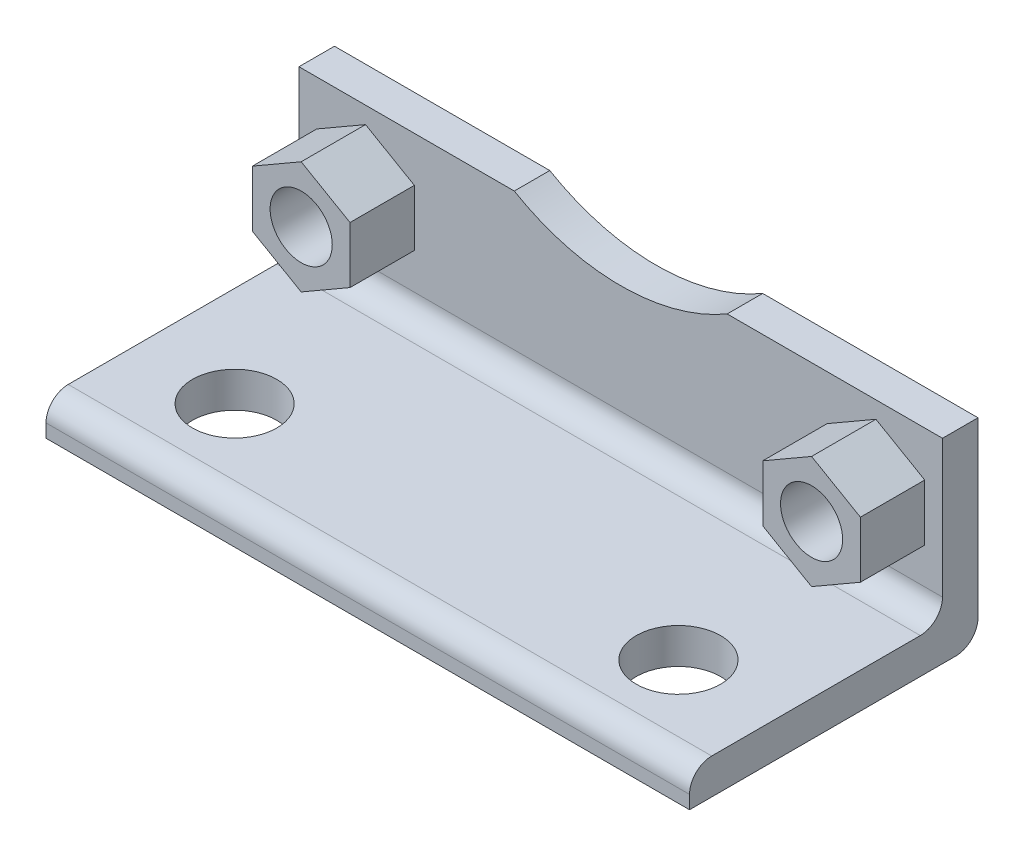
ISO-10303-21;
HEADER;
FILE_DESCRIPTION(('STEP AP214'),'2;1');
FILE_NAME('part.step','',(''),(''),'','','');
FILE_SCHEMA(('AUTOMOTIVE_DESIGN { 1 0 10303 214 1 1 1 1 }'));
ENDSEC;
DATA;
#1=APPLICATION_CONTEXT('core data for automotive mechanical design processes');
#2=APPLICATION_PROTOCOL_DEFINITION('international standard','automotive_design',2000,#1);
#3=PRODUCT_CONTEXT('',#1,'mechanical');
#4=PRODUCT('Part','Part','',(#3));
#5=PRODUCT_RELATED_PRODUCT_CATEGORY('part','',(#4));
#6=PRODUCT_DEFINITION_FORMATION('','',#4);
#7=PRODUCT_DEFINITION_CONTEXT('part definition',#1,'design');
#8=PRODUCT_DEFINITION('design','',#6,#7);
#9=PRODUCT_DEFINITION_SHAPE('','',#8);
#10=(LENGTH_UNIT() NAMED_UNIT(*) SI_UNIT(.MILLI.,.METRE.));
#11=(NAMED_UNIT(*) PLANE_ANGLE_UNIT() SI_UNIT($,.RADIAN.));
#12=(NAMED_UNIT(*) SI_UNIT($,.STERADIAN.) SOLID_ANGLE_UNIT());
#13=UNCERTAINTY_MEASURE_WITH_UNIT(LENGTH_MEASURE(1.E-05),#10,'distance_accuracy_value','');
#14=(GEOMETRIC_REPRESENTATION_CONTEXT(3) GLOBAL_UNCERTAINTY_ASSIGNED_CONTEXT((#13)) GLOBAL_UNIT_ASSIGNED_CONTEXT((#10,
#11,#12)) REPRESENTATION_CONTEXT('',''));
#15=CARTESIAN_POINT('',(0.,0.,0.));
#16=DIRECTION('',(0.,0.,1.));
#17=DIRECTION('',(1.,0.,0.));
#18=AXIS2_PLACEMENT_3D('',#15,#16,#17);
#19=CARTESIAN_POINT('',(-72.5,-41.,-37.));
#20=DIRECTION('',(0.,1.,0.));
#21=DIRECTION('',(0.,0.,1.));
#22=AXIS2_PLACEMENT_3D('',#19,#20,#21);
#23=PLANE('',#22);
#24=DIRECTION('',(0.,0.,1.));
#25=VECTOR('',#24,1.);
#26=CARTESIAN_POINT('',(-23.9843699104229,-41.,-45.));
#27=LINE('',#26,#25);
#28=CARTESIAN_POINT('',(-23.9843699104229,-41.,-45.));
#29=VERTEX_POINT('',#28);
#30=CARTESIAN_POINT('',(-23.9843699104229,-41.,-37.));
#31=VERTEX_POINT('',#30);
#32=EDGE_CURVE('E189',#29,#31,#27,.T.);
#33=ORIENTED_EDGE('',*,*,#32,.F.);
#34=DIRECTION('',(1.,0.,0.));
#35=VECTOR('',#34,1.);
#36=CARTESIAN_POINT('',(-72.5,-41.,-45.));
#37=LINE('',#36,#35);
#38=CARTESIAN_POINT('',(-72.5,-41.,-45.));
#39=VERTEX_POINT('',#38);
#40=EDGE_CURVE('E200',#39,#29,#37,.T.);
#41=ORIENTED_EDGE('',*,*,#40,.F.);
#42=DIRECTION('',(0.,0.,1.));
#43=VECTOR('',#42,1.);
#44=CARTESIAN_POINT('',(-72.5,-41.,-37.));
#45=LINE('',#44,#43);
#46=CARTESIAN_POINT('',(-72.5,-41.,-37.));
#47=VERTEX_POINT('',#46);
#48=EDGE_CURVE('E272',#39,#47,#45,.T.);
#49=ORIENTED_EDGE('',*,*,#48,.T.);
#50=DIRECTION('',(1.,0.,0.));
#51=VECTOR('',#50,1.);
#52=CARTESIAN_POINT('',(-72.5,-41.,-37.));
#53=LINE('',#52,#51);
#54=EDGE_CURVE('E202',#47,#31,#53,.T.);
#55=ORIENTED_EDGE('',*,*,#54,.T.);
#56=EDGE_LOOP('',(#33,#41,#49,#55));
#57=FACE_BOUND('',#56,.T.);
#58=ADVANCED_FACE('F34',(#57),#23,.T.);
#59=CARTESIAN_POINT('',(-72.5,-77.,-37.));
#60=DIRECTION('',(0.,0.,1.));
#61=DIRECTION('',(1.,0.,0.));
#62=AXIS2_PLACEMENT_3D('',#59,#60,#61);
#63=PLANE('',#62);
#64=CARTESIAN_POINT('',(0.,0.,-37.));
#65=DIRECTION('',(0.,0.,1.));
#66=DIRECTION('',(1.,0.,0.));
#67=AXIS2_PLACEMENT_3D('',#64,#65,#66);
#68=CIRCLE('',#67,47.5);
#69=CARTESIAN_POINT('',(23.9843699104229,-41.,-37.));
#70=VERTEX_POINT('',#69);
#71=EDGE_CURVE('E194',#31,#70,#68,.T.);
#72=ORIENTED_EDGE('',*,*,#71,.F.);
#73=ORIENTED_EDGE('',*,*,#54,.F.);
#74=DIRECTION('',(0.,-1.,0.));
#75=VECTOR('',#74,1.);
#76=CARTESIAN_POINT('',(-72.5,-77.,-37.));
#77=LINE('',#76,#75);
#78=CARTESIAN_POINT('',(-72.5,-72.,-37.));
#79=VERTEX_POINT('',#78);
#80=EDGE_CURVE('E267',#47,#79,#77,.T.);
#81=ORIENTED_EDGE('',*,*,#80,.T.);
#82=DIRECTION('',(1.,0.,0.));
#83=VECTOR('',#82,1.);
#84=CARTESIAN_POINT('',(72.5,-72.,-37.));
#85=LINE('',#84,#83);
#86=CARTESIAN_POINT('',(72.5,-72.,-37.));
#87=VERTEX_POINT('',#86);
#88=EDGE_CURVE('E209',#79,#87,#85,.T.);
#89=ORIENTED_EDGE('',*,*,#88,.T.);
#90=DIRECTION('',(0.,-1.,0.));
#91=VECTOR('',#90,1.);
#92=CARTESIAN_POINT('',(72.5,-77.,-37.));
#93=LINE('',#92,#91);
#94=CARTESIAN_POINT('',(72.5,-41.,-37.));
#95=VERTEX_POINT('',#94);
#96=EDGE_CURVE('E250',#95,#87,#93,.T.);
#97=ORIENTED_EDGE('',*,*,#96,.F.);
#98=EDGE_CURVE('E222',#70,#95,#53,.T.);
#99=ORIENTED_EDGE('',*,*,#98,.F.);
#100=EDGE_LOOP('',(#72,#73,#81,#89,#97,#99));
#101=FACE_BOUND('',#100,.T.);
#102=DIRECTION('',(0.866025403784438,0.5,0.));
#103=VECTOR('',#102,1.);
#104=CARTESIAN_POINT('',(57.5,-70.2017059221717,-37.));
#105=LINE('',#104,#103);
#106=CARTESIAN_POINT('',(57.5,-70.2017059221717,-37.));
#107=VERTEX_POINT('',#106);
#108=CARTESIAN_POINT('',(68.5000000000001,-63.8508529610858,-37.));
#109=VERTEX_POINT('',#108);
#110=EDGE_CURVE('E366',#107,#109,#105,.T.);
#111=ORIENTED_EDGE('',*,*,#110,.F.);
#112=DIRECTION('',(0.866025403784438,-0.5,0.));
#113=VECTOR('',#112,1.);
#114=CARTESIAN_POINT('',(46.5000000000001,-63.8508529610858,-37.));
#115=LINE('',#114,#113);
#116=CARTESIAN_POINT('',(46.5000000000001,-63.8508529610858,-37.));
#117=VERTEX_POINT('',#116);
#118=EDGE_CURVE('E348',#117,#107,#115,.T.);
#119=ORIENTED_EDGE('',*,*,#118,.F.);
#120=DIRECTION('',(0.,-1.,0.));
#121=VECTOR('',#120,1.);
#122=CARTESIAN_POINT('',(46.5000000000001,-51.1491470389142,-37.));
#123=LINE('',#122,#121);
#124=CARTESIAN_POINT('',(46.5000000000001,-51.1491470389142,-37.));
#125=VERTEX_POINT('',#124);
#126=EDGE_CURVE('E353',#125,#117,#123,.T.);
#127=ORIENTED_EDGE('',*,*,#126,.F.);
#128=DIRECTION('',(-0.866025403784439,-0.499999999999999,0.));
#129=VECTOR('',#128,1.);
#130=CARTESIAN_POINT('',(57.5,-44.7982940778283,-37.));
#131=LINE('',#130,#129);
#132=CARTESIAN_POINT('',(57.5,-44.7982940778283,-37.));
#133=VERTEX_POINT('',#132);
#134=EDGE_CURVE('E372',#133,#125,#131,.T.);
#135=ORIENTED_EDGE('',*,*,#134,.F.);
#136=DIRECTION('',(-0.866025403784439,0.5,0.));
#137=VECTOR('',#136,1.);
#138=CARTESIAN_POINT('',(68.5000000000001,-51.1491470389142,-37.));
#139=LINE('',#138,#137);
#140=CARTESIAN_POINT('',(68.5000000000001,-51.1491470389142,-37.));
#141=VERTEX_POINT('',#140);
#142=EDGE_CURVE('E370',#141,#133,#139,.T.);
#143=ORIENTED_EDGE('',*,*,#142,.F.);
#144=DIRECTION('',(0.,1.,0.));
#145=VECTOR('',#144,1.);
#146=CARTESIAN_POINT('',(68.5000000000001,-63.8508529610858,-37.));
#147=LINE('',#146,#145);
#148=EDGE_CURVE('E368',#109,#141,#147,.T.);
#149=ORIENTED_EDGE('',*,*,#148,.F.);
#150=EDGE_LOOP('',(#111,#119,#127,#135,#143,#149));
#151=FACE_BOUND('',#150,.T.);
#152=DIRECTION('',(0.866025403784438,0.500000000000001,0.));
#153=VECTOR('',#152,1.);
#154=CARTESIAN_POINT('',(-57.5,-70.2017059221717,-37.));
#155=LINE('',#154,#153);
#156=CARTESIAN_POINT('',(-57.5,-70.2017059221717,-37.));
#157=VERTEX_POINT('',#156);
#158=CARTESIAN_POINT('',(-46.5000000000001,-63.8508529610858,-37.));
#159=VERTEX_POINT('',#158);
#160=EDGE_CURVE('E320',#157,#159,#155,.T.);
#161=ORIENTED_EDGE('',*,*,#160,.F.);
#162=DIRECTION('',(0.866025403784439,-0.5,0.));
#163=VECTOR('',#162,1.);
#164=CARTESIAN_POINT('',(-68.4999999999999,-63.8508529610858,-37.));
#165=LINE('',#164,#163);
#166=CARTESIAN_POINT('',(-68.4999999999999,-63.8508529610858,-37.));
#167=VERTEX_POINT('',#166);
#168=EDGE_CURVE('E302',#167,#157,#165,.T.);
#169=ORIENTED_EDGE('',*,*,#168,.F.);
#170=DIRECTION('',(0.,-1.,0.));
#171=VECTOR('',#170,1.);
#172=CARTESIAN_POINT('',(-68.4999999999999,-51.1491470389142,-37.));
#173=LINE('',#172,#171);
#174=CARTESIAN_POINT('',(-68.4999999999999,-51.1491470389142,-37.));
#175=VERTEX_POINT('',#174);
#176=EDGE_CURVE('E307',#175,#167,#173,.T.);
#177=ORIENTED_EDGE('',*,*,#176,.F.);
#178=DIRECTION('',(-0.866025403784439,-0.5,0.));
#179=VECTOR('',#178,1.);
#180=CARTESIAN_POINT('',(-57.5,-44.7982940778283,-37.));
#181=LINE('',#180,#179);
#182=CARTESIAN_POINT('',(-57.5,-44.7982940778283,-37.));
#183=VERTEX_POINT('',#182);
#184=EDGE_CURVE('E326',#183,#175,#181,.T.);
#185=ORIENTED_EDGE('',*,*,#184,.F.);
#186=DIRECTION('',(-0.866025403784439,0.5,0.));
#187=VECTOR('',#186,1.);
#188=CARTESIAN_POINT('',(-46.5000000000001,-51.1491470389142,-37.));
#189=LINE('',#188,#187);
#190=CARTESIAN_POINT('',(-46.5000000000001,-51.1491470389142,-37.));
#191=VERTEX_POINT('',#190);
#192=EDGE_CURVE('E324',#191,#183,#189,.T.);
#193=ORIENTED_EDGE('',*,*,#192,.F.);
#194=DIRECTION('',(0.,1.,0.));
#195=VECTOR('',#194,1.);
#196=CARTESIAN_POINT('',(-46.5000000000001,-63.8508529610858,-37.));
#197=LINE('',#196,#195);
#198=EDGE_CURVE('E322',#159,#191,#197,.T.);
#199=ORIENTED_EDGE('',*,*,#198,.F.);
#200=EDGE_LOOP('',(#161,#169,#177,#185,#193,#199));
#201=FACE_BOUND('',#200,.T.);
#202=ADVANCED_FACE('F270',(#101,#151,#201),#63,.T.);
#203=DIRECTION('',(0.,0.,1.));
#204=VECTOR('',#203,1.);
#205=CARTESIAN_POINT('',(23.9843699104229,-41.,-45.));
#206=LINE('',#205,#204);
#207=CARTESIAN_POINT('',(23.9843699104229,-41.,-45.));
#208=VERTEX_POINT('',#207);
#209=EDGE_CURVE('E49',#70,#208,#206,.F.);
#210=ORIENTED_EDGE('',*,*,#209,.F.);
#211=ORIENTED_EDGE('',*,*,#98,.T.);
#212=DIRECTION('',(0.,0.,1.));
#213=VECTOR('',#212,1.);
#214=CARTESIAN_POINT('',(72.5,-41.,-37.));
#215=LINE('',#214,#213);
#216=CARTESIAN_POINT('',(72.5,-41.,-45.));
#217=VERTEX_POINT('',#216);
#218=EDGE_CURVE('E284',#217,#95,#215,.T.);
#219=ORIENTED_EDGE('',*,*,#218,.F.);
#220=EDGE_CURVE('E210',#208,#217,#37,.T.);
#221=ORIENTED_EDGE('',*,*,#220,.F.);
#222=EDGE_LOOP('',(#210,#211,#219,#221));
#223=FACE_BOUND('',#222,.T.);
#224=ADVANCED_FACE('F295',(#223),#23,.T.);
#225=CARTESIAN_POINT('',(-72.5,-41.,-45.));
#226=DIRECTION('',(0.,0.,-1.));
#227=DIRECTION('',(0.,1.,0.));
#228=AXIS2_PLACEMENT_3D('',#225,#226,#227);
#229=PLANE('',#228);
#230=CARTESIAN_POINT('',(0.,0.,-45.));
#231=DIRECTION('',(0.,0.,1.));
#232=DIRECTION('',(1.,0.,0.));
#233=AXIS2_PLACEMENT_3D('',#230,#231,#232);
#234=CIRCLE('',#233,47.5);
#235=EDGE_CURVE('E186',#29,#208,#234,.T.);
#236=ORIENTED_EDGE('',*,*,#235,.T.);
#237=ORIENTED_EDGE('',*,*,#220,.T.);
#238=DIRECTION('',(0.,1.,0.));
#239=VECTOR('',#238,1.);
#240=CARTESIAN_POINT('',(72.5,-41.,-45.));
#241=LINE('',#240,#239);
#242=CARTESIAN_POINT('',(72.5,-80.,-45.));
#243=VERTEX_POINT('',#242);
#244=EDGE_CURVE('E218',#243,#217,#241,.T.);
#245=ORIENTED_EDGE('',*,*,#244,.F.);
#246=DIRECTION('',(1.,0.,0.));
#247=VECTOR('',#246,1.);
#248=CARTESIAN_POINT('',(-72.5,-80.,-45.));
#249=LINE('',#248,#247);
#250=CARTESIAN_POINT('',(-72.5,-80.,-45.));
#251=VERTEX_POINT('',#250);
#252=EDGE_CURVE('E235',#243,#251,#249,.F.);
#253=ORIENTED_EDGE('',*,*,#252,.T.);
#254=DIRECTION('',(0.,1.,0.));
#255=VECTOR('',#254,1.);
#256=CARTESIAN_POINT('',(-72.5,-41.,-45.));
#257=LINE('',#256,#255);
#258=EDGE_CURVE('E208',#251,#39,#257,.T.);
#259=ORIENTED_EDGE('',*,*,#258,.T.);
#260=ORIENTED_EDGE('',*,*,#40,.T.);
#261=EDGE_LOOP('',(#236,#237,#245,#253,#259,#260));
#262=FACE_BOUND('',#261,.T.);
#263=CARTESIAN_POINT('',(-57.5,-57.5,-45.));
#264=DIRECTION('',(0.,0.,1.));
#265=DIRECTION('',(-1.,0.,0.));
#266=AXIS2_PLACEMENT_3D('',#263,#264,#265);
#267=CIRCLE('',#266,7.);
#268=CARTESIAN_POINT('',(-64.5,-57.5,-45.));
#269=VERTEX_POINT('',#268);
#270=EDGE_CURVE('E391',#269,#269,#267,.T.);
#271=ORIENTED_EDGE('',*,*,#270,.T.);
#272=EDGE_LOOP('',(#271));
#273=FACE_BOUND('',#272,.T.);
#274=CARTESIAN_POINT('',(57.5,-57.5,-45.));
#275=DIRECTION('',(0.,0.,1.));
#276=DIRECTION('',(1.,0.,0.));
#277=AXIS2_PLACEMENT_3D('',#274,#275,#276);
#278=CIRCLE('',#277,6.99999999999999);
#279=CARTESIAN_POINT('',(64.5,-57.5,-45.));
#280=VERTEX_POINT('',#279);
#281=EDGE_CURVE('E394',#280,#280,#278,.T.);
#282=ORIENTED_EDGE('',*,*,#281,.T.);
#283=EDGE_LOOP('',(#282));
#284=FACE_BOUND('',#283,.T.);
#285=ADVANCED_FACE('F205',(#262,#273,#284),#229,.T.);
#286=CARTESIAN_POINT('',(-72.5,-85.,-45.));
#287=DIRECTION('',(0.,-1.,0.));
#288=DIRECTION('',(0.,0.,-1.));
#289=AXIS2_PLACEMENT_3D('',#286,#287,#288);
#290=PLANE('',#289);
#291=CARTESIAN_POINT('',(-50.,-85.,0.));
#292=DIRECTION('',(0.,1.,0.));
#293=DIRECTION('',(0.,0.,-1.));
#294=AXIS2_PLACEMENT_3D('',#291,#292,#293);
#295=CIRCLE('',#294,9.5);
#296=CARTESIAN_POINT('',(-50.,-85.,-9.5));
#297=VERTEX_POINT('',#296);
#298=EDGE_CURVE('E398',#297,#297,#295,.T.);
#299=ORIENTED_EDGE('',*,*,#298,.T.);
#300=EDGE_LOOP('',(#299));
#301=FACE_BOUND('',#300,.T.);
#302=CARTESIAN_POINT('',(50.,-85.,0.));
#303=DIRECTION('',(0.,1.,0.));
#304=DIRECTION('',(0.,0.,1.));
#305=AXIS2_PLACEMENT_3D('',#302,#303,#304);
#306=CIRCLE('',#305,9.5);
#307=CARTESIAN_POINT('',(50.,-85.,9.5));
#308=VERTEX_POINT('',#307);
#309=EDGE_CURVE('E286',#308,#308,#306,.T.);
#310=ORIENTED_EDGE('',*,*,#309,.T.);
#311=EDGE_LOOP('',(#310));
#312=FACE_BOUND('',#311,.T.);
#313=DIRECTION('',(0.,0.,-1.));
#314=VECTOR('',#313,1.);
#315=CARTESIAN_POINT('',(-72.5,-85.,-45.));
#316=LINE('',#315,#314);
#317=CARTESIAN_POINT('',(-72.5,-85.,20.));
#318=VERTEX_POINT('',#317);
#319=CARTESIAN_POINT('',(-72.5,-85.,-40.));
#320=VERTEX_POINT('',#319);
#321=EDGE_CURVE('E280',#318,#320,#316,.T.);
#322=ORIENTED_EDGE('',*,*,#321,.T.);
#323=DIRECTION('',(1.,0.,0.));
#324=VECTOR('',#323,1.);
#325=CARTESIAN_POINT('',(-72.5,-85.,-40.));
#326=LINE('',#325,#324);
#327=CARTESIAN_POINT('',(72.5,-85.,-40.));
#328=VERTEX_POINT('',#327);
#329=EDGE_CURVE('E228',#320,#328,#326,.T.);
#330=ORIENTED_EDGE('',*,*,#329,.T.);
#331=DIRECTION('',(0.,0.,-1.));
#332=VECTOR('',#331,1.);
#333=CARTESIAN_POINT('',(72.5,-85.,-45.));
#334=LINE('',#333,#332);
#335=CARTESIAN_POINT('',(72.5,-85.,20.));
#336=VERTEX_POINT('',#335);
#337=EDGE_CURVE('E288',#336,#328,#334,.T.);
#338=ORIENTED_EDGE('',*,*,#337,.F.);
#339=DIRECTION('',(1.,0.,0.));
#340=VECTOR('',#339,1.);
#341=CARTESIAN_POINT('',(-72.5,-85.,20.));
#342=LINE('',#341,#340);
#343=EDGE_CURVE('E215',#318,#336,#342,.T.);
#344=ORIENTED_EDGE('',*,*,#343,.F.);
#345=EDGE_LOOP('',(#322,#330,#338,#344));
#346=FACE_BOUND('',#345,.T.);
#347=ADVANCED_FACE('F419',(#301,#312,#346),#290,.T.);
#348=CARTESIAN_POINT('',(-72.5,-85.,20.));
#349=DIRECTION('',(0.,0.,1.));
#350=DIRECTION('',(1.,0.,0.));
#351=AXIS2_PLACEMENT_3D('',#348,#349,#350);
#352=PLANE('',#351);
#353=DIRECTION('',(0.,-1.,0.));
#354=VECTOR('',#353,1.);
#355=CARTESIAN_POINT('',(72.5,-85.,20.));
#356=LINE('',#355,#354);
#357=CARTESIAN_POINT('',(72.5,-82.,20.));
#358=VERTEX_POINT('',#357);
#359=EDGE_CURVE('E259',#358,#336,#356,.T.);
#360=ORIENTED_EDGE('',*,*,#359,.F.);
#361=DIRECTION('',(1.,0.,0.));
#362=VECTOR('',#361,1.);
#363=CARTESIAN_POINT('',(-72.5,-82.,20.));
#364=LINE('',#363,#362);
#365=CARTESIAN_POINT('',(-72.5,-82.,20.));
#366=VERTEX_POINT('',#365);
#367=EDGE_CURVE('E57',#358,#366,#364,.F.);
#368=ORIENTED_EDGE('',*,*,#367,.T.);
#369=DIRECTION('',(0.,-1.,0.));
#370=VECTOR('',#369,1.);
#371=CARTESIAN_POINT('',(-72.5,-85.,20.));
#372=LINE('',#371,#370);
#373=EDGE_CURVE('E274',#366,#318,#372,.T.);
#374=ORIENTED_EDGE('',*,*,#373,.T.);
#375=ORIENTED_EDGE('',*,*,#343,.T.);
#376=EDGE_LOOP('',(#360,#368,#374,#375));
#377=FACE_BOUND('',#376,.T.);
#378=ADVANCED_FACE('F411',(#377),#352,.T.);
#379=CARTESIAN_POINT('',(-72.5,-77.,20.));
#380=DIRECTION('',(0.,1.,0.));
#381=DIRECTION('',(0.,0.,1.));
#382=AXIS2_PLACEMENT_3D('',#379,#380,#381);
#383=PLANE('',#382);
#384=CARTESIAN_POINT('',(-50.,-77.,0.));
#385=DIRECTION('',(0.,1.,0.));
#386=DIRECTION('',(0.,0.,-1.));
#387=AXIS2_PLACEMENT_3D('',#384,#385,#386);
#388=CIRCLE('',#387,9.5);
#389=CARTESIAN_POINT('',(-50.,-77.,-9.5));
#390=VERTEX_POINT('',#389);
#391=EDGE_CURVE('E397',#390,#390,#388,.T.);
#392=ORIENTED_EDGE('',*,*,#391,.F.);
#393=EDGE_LOOP('',(#392));
#394=FACE_BOUND('',#393,.T.);
#395=CARTESIAN_POINT('',(50.,-77.,0.));
#396=DIRECTION('',(0.,1.,0.));
#397=DIRECTION('',(0.,0.,1.));
#398=AXIS2_PLACEMENT_3D('',#395,#396,#397);
#399=CIRCLE('',#398,9.5);
#400=CARTESIAN_POINT('',(50.,-77.,9.5));
#401=VERTEX_POINT('',#400);
#402=EDGE_CURVE('E401',#401,#401,#399,.T.);
#403=ORIENTED_EDGE('',*,*,#402,.F.);
#404=EDGE_LOOP('',(#403));
#405=FACE_BOUND('',#404,.T.);
#406=DIRECTION('',(0.,0.,1.));
#407=VECTOR('',#406,1.);
#408=CARTESIAN_POINT('',(72.5,-77.,20.));
#409=LINE('',#408,#407);
#410=CARTESIAN_POINT('',(72.5,-77.,-32.));
#411=VERTEX_POINT('',#410);
#412=CARTESIAN_POINT('',(72.5,-77.,15.));
#413=VERTEX_POINT('',#412);
#414=EDGE_CURVE('E247',#411,#413,#409,.T.);
#415=ORIENTED_EDGE('',*,*,#414,.F.);
#416=DIRECTION('',(1.,0.,0.));
#417=VECTOR('',#416,1.);
#418=CARTESIAN_POINT('',(-72.5,-77.,-32.));
#419=LINE('',#418,#417);
#420=CARTESIAN_POINT('',(-72.5,-77.,-32.));
#421=VERTEX_POINT('',#420);
#422=EDGE_CURVE('E226',#411,#421,#419,.F.);
#423=ORIENTED_EDGE('',*,*,#422,.T.);
#424=DIRECTION('',(0.,0.,1.));
#425=VECTOR('',#424,1.);
#426=CARTESIAN_POINT('',(-72.5,-77.,20.));
#427=LINE('',#426,#425);
#428=CARTESIAN_POINT('',(-72.5,-77.,15.));
#429=VERTEX_POINT('',#428);
#430=EDGE_CURVE('E268',#421,#429,#427,.T.);
#431=ORIENTED_EDGE('',*,*,#430,.T.);
#432=DIRECTION('',(1.,0.,0.));
#433=VECTOR('',#432,1.);
#434=CARTESIAN_POINT('',(-72.5,-77.,15.));
#435=LINE('',#434,#433);
#436=EDGE_CURVE('E213',#429,#413,#435,.T.);
#437=ORIENTED_EDGE('',*,*,#436,.T.);
#438=EDGE_LOOP('',(#415,#423,#431,#437));
#439=FACE_BOUND('',#438,.T.);
#440=ADVANCED_FACE('F255',(#394,#405,#439),#383,.T.);
#441=CARTESIAN_POINT('',(-72.5,-41.,20.));
#442=DIRECTION('',(1.,0.,0.));
#443=DIRECTION('',(0.,0.,-1.));
#444=AXIS2_PLACEMENT_3D('',#441,#442,#443);
#445=PLANE('',#444);
#446=ORIENTED_EDGE('',*,*,#258,.F.);
#447=CARTESIAN_POINT('',(-72.5,-80.,-40.));
#448=DIRECTION('',(1.,0.,0.));
#449=DIRECTION('',(0.,0.,-1.));
#450=AXIS2_PLACEMENT_3D('',#447,#448,#449);
#451=CIRCLE('',#450,5.);
#452=EDGE_CURVE('E239',#251,#320,#451,.F.);
#453=ORIENTED_EDGE('',*,*,#452,.T.);
#454=ORIENTED_EDGE('',*,*,#321,.F.);
#455=ORIENTED_EDGE('',*,*,#373,.F.);
#456=CARTESIAN_POINT('',(-72.5,-82.,15.));
#457=DIRECTION('',(1.,0.,0.));
#458=DIRECTION('',(0.,0.,-1.));
#459=AXIS2_PLACEMENT_3D('',#456,#457,#458);
#460=CIRCLE('',#459,5.);
#461=EDGE_CURVE('E237',#366,#429,#460,.F.);
#462=ORIENTED_EDGE('',*,*,#461,.T.);
#463=ORIENTED_EDGE('',*,*,#430,.F.);
#464=CARTESIAN_POINT('',(-72.5,-72.,-32.));
#465=DIRECTION('',(1.,0.,0.));
#466=DIRECTION('',(0.,0.,-1.));
#467=AXIS2_PLACEMENT_3D('',#464,#465,#466);
#468=CIRCLE('',#467,5.);
#469=EDGE_CURVE('E11',#421,#79,#468,.T.);
#470=ORIENTED_EDGE('',*,*,#469,.T.);
#471=ORIENTED_EDGE('',*,*,#80,.F.);
#472=ORIENTED_EDGE('',*,*,#48,.F.);
#473=EDGE_LOOP('',(#446,#453,#454,#455,#462,#463,#470,#471,#472));
#474=FACE_BOUND('',#473,.T.);
#475=ADVANCED_FACE('F266',(#474),#445,.F.);
#476=CARTESIAN_POINT('',(72.5,-41.,20.));
#477=DIRECTION('',(1.,0.,0.));
#478=DIRECTION('',(0.,0.,-1.));
#479=AXIS2_PLACEMENT_3D('',#476,#477,#478);
#480=PLANE('',#479);
#481=ORIENTED_EDGE('',*,*,#337,.T.);
#482=CARTESIAN_POINT('',(72.5,-80.,-40.));
#483=DIRECTION('',(1.,0.,0.));
#484=DIRECTION('',(0.,0.,-1.));
#485=AXIS2_PLACEMENT_3D('',#482,#483,#484);
#486=CIRCLE('',#485,5.);
#487=EDGE_CURVE('E233',#328,#243,#486,.T.);
#488=ORIENTED_EDGE('',*,*,#487,.T.);
#489=ORIENTED_EDGE('',*,*,#244,.T.);
#490=ORIENTED_EDGE('',*,*,#218,.T.);
#491=ORIENTED_EDGE('',*,*,#96,.T.);
#492=CARTESIAN_POINT('',(72.5,-72.,-32.));
#493=DIRECTION('',(1.,0.,0.));
#494=DIRECTION('',(0.,0.,-1.));
#495=AXIS2_PLACEMENT_3D('',#492,#493,#494);
#496=CIRCLE('',#495,5.);
#497=EDGE_CURVE('E42',#87,#411,#496,.F.);
#498=ORIENTED_EDGE('',*,*,#497,.T.);
#499=ORIENTED_EDGE('',*,*,#414,.T.);
#500=CARTESIAN_POINT('',(72.5,-82.,15.));
#501=DIRECTION('',(1.,0.,0.));
#502=DIRECTION('',(0.,0.,-1.));
#503=AXIS2_PLACEMENT_3D('',#500,#501,#502);
#504=CIRCLE('',#503,5.);
#505=EDGE_CURVE('E231',#413,#358,#504,.T.);
#506=ORIENTED_EDGE('',*,*,#505,.T.);
#507=ORIENTED_EDGE('',*,*,#359,.T.);
#508=EDGE_LOOP('',(#481,#488,#489,#490,#491,#498,#499,#506,#507));
#509=FACE_BOUND('',#508,.T.);
#510=ADVANCED_FACE('F246',(#509),#480,.T.);
#511=CARTESIAN_POINT('',(50.,-85.,0.));
#512=DIRECTION('',(0.,1.,0.));
#513=DIRECTION('',(0.,0.,1.));
#514=AXIS2_PLACEMENT_3D('',#511,#512,#513);
#515=CYLINDRICAL_SURFACE('',#514,9.5);
#516=ORIENTED_EDGE('',*,*,#309,.F.);
#517=EDGE_LOOP('',(#516));
#518=FACE_BOUND('',#517,.T.);
#519=ORIENTED_EDGE('',*,*,#402,.T.);
#520=EDGE_LOOP('',(#519));
#521=FACE_BOUND('',#520,.T.);
#522=ADVANCED_FACE('F408',(#518,#521),#515,.F.);
#523=CARTESIAN_POINT('',(-50.,-85.,0.));
#524=DIRECTION('',(0.,1.,0.));
#525=DIRECTION('',(0.,0.,1.));
#526=AXIS2_PLACEMENT_3D('',#523,#524,#525);
#527=CYLINDRICAL_SURFACE('',#526,9.5);
#528=ORIENTED_EDGE('',*,*,#298,.F.);
#529=EDGE_LOOP('',(#528));
#530=FACE_BOUND('',#529,.T.);
#531=ORIENTED_EDGE('',*,*,#391,.T.);
#532=EDGE_LOOP('',(#531));
#533=FACE_BOUND('',#532,.T.);
#534=ADVANCED_FACE('F444',(#530,#533),#527,.F.);
#535=CARTESIAN_POINT('',(57.5,-57.5,-45.));
#536=DIRECTION('',(0.,0.,1.));
#537=DIRECTION('',(1.,0.,0.));
#538=AXIS2_PLACEMENT_3D('',#535,#536,#537);
#539=CYLINDRICAL_SURFACE('',#538,6.99999999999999);
#540=ORIENTED_EDGE('',*,*,#281,.F.);
#541=EDGE_LOOP('',(#540));
#542=FACE_BOUND('',#541,.T.);
#543=CARTESIAN_POINT('',(57.5,-57.5,-22.5));
#544=DIRECTION('',(0.,0.,1.));
#545=DIRECTION('',(1.,0.,0.));
#546=AXIS2_PLACEMENT_3D('',#543,#544,#545);
#547=CIRCLE('',#546,6.99999999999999);
#548=CARTESIAN_POINT('',(64.5,-57.5,-22.5));
#549=VERTEX_POINT('',#548);
#550=EDGE_CURVE('E345',#549,#549,#547,.T.);
#551=ORIENTED_EDGE('',*,*,#550,.T.);
#552=EDGE_LOOP('',(#551));
#553=FACE_BOUND('',#552,.T.);
#554=ADVANCED_FACE('F448',(#542,#553),#539,.F.);
#555=CARTESIAN_POINT('',(-57.5,-57.5,-45.));
#556=DIRECTION('',(0.,0.,1.));
#557=DIRECTION('',(1.,0.,0.));
#558=AXIS2_PLACEMENT_3D('',#555,#556,#557);
#559=CYLINDRICAL_SURFACE('',#558,7.);
#560=ORIENTED_EDGE('',*,*,#270,.F.);
#561=EDGE_LOOP('',(#560));
#562=FACE_BOUND('',#561,.T.);
#563=CARTESIAN_POINT('',(-57.5,-57.5,-22.5));
#564=DIRECTION('',(0.,0.,1.));
#565=DIRECTION('',(1.,0.,0.));
#566=AXIS2_PLACEMENT_3D('',#563,#564,#565);
#567=CIRCLE('',#566,7.);
#568=CARTESIAN_POINT('',(-50.5,-57.5,-22.5));
#569=VERTEX_POINT('',#568);
#570=EDGE_CURVE('E203',#569,#569,#567,.T.);
#571=ORIENTED_EDGE('',*,*,#570,.T.);
#572=EDGE_LOOP('',(#571));
#573=FACE_BOUND('',#572,.T.);
#574=ADVANCED_FACE('F452',(#562,#573),#559,.F.);
#575=CARTESIAN_POINT('',(57.5000000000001,-70.2017059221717,-22.5));
#576=DIRECTION('',(0.,0.,1.));
#577=DIRECTION('',(1.,0.,0.));
#578=AXIS2_PLACEMENT_3D('',#575,#576,#577);
#579=PLANE('',#578);
#580=DIRECTION('',(0.866025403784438,-0.5,0.));
#581=VECTOR('',#580,1.);
#582=CARTESIAN_POINT('',(46.5000000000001,-63.8508529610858,-22.5));
#583=LINE('',#582,#581);
#584=CARTESIAN_POINT('',(46.5000000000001,-63.8508529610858,-22.5));
#585=VERTEX_POINT('',#584);
#586=CARTESIAN_POINT('',(57.5,-70.2017059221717,-22.5));
#587=VERTEX_POINT('',#586);
#588=EDGE_CURVE('E349',#585,#587,#583,.T.);
#589=ORIENTED_EDGE('',*,*,#588,.T.);
#590=DIRECTION('',(0.866025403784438,0.5,0.));
#591=VECTOR('',#590,1.);
#592=CARTESIAN_POINT('',(57.5,-70.2017059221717,-22.5));
#593=LINE('',#592,#591);
#594=CARTESIAN_POINT('',(68.5000000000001,-63.8508529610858,-22.5));
#595=VERTEX_POINT('',#594);
#596=EDGE_CURVE('E352',#587,#595,#593,.T.);
#597=ORIENTED_EDGE('',*,*,#596,.T.);
#598=DIRECTION('',(0.,1.,0.));
#599=VECTOR('',#598,1.);
#600=CARTESIAN_POINT('',(68.5000000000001,-63.8508529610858,-22.5));
#601=LINE('',#600,#599);
#602=CARTESIAN_POINT('',(68.5000000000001,-51.1491470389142,-22.5));
#603=VERTEX_POINT('',#602);
#604=EDGE_CURVE('E355',#595,#603,#601,.T.);
#605=ORIENTED_EDGE('',*,*,#604,.T.);
#606=DIRECTION('',(-0.866025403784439,0.5,0.));
#607=VECTOR('',#606,1.);
#608=CARTESIAN_POINT('',(68.5000000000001,-51.1491470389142,-22.5));
#609=LINE('',#608,#607);
#610=CARTESIAN_POINT('',(57.5,-44.7982940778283,-22.5));
#611=VERTEX_POINT('',#610);
#612=EDGE_CURVE('E357',#603,#611,#609,.T.);
#613=ORIENTED_EDGE('',*,*,#612,.T.);
#614=DIRECTION('',(-0.866025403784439,-0.499999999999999,0.));
#615=VECTOR('',#614,1.);
#616=CARTESIAN_POINT('',(57.5,-44.7982940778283,-22.5));
#617=LINE('',#616,#615);
#618=CARTESIAN_POINT('',(46.5000000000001,-51.1491470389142,-22.5));
#619=VERTEX_POINT('',#618);
#620=EDGE_CURVE('E359',#611,#619,#617,.T.);
#621=ORIENTED_EDGE('',*,*,#620,.T.);
#622=DIRECTION('',(0.,-1.,0.));
#623=VECTOR('',#622,1.);
#624=CARTESIAN_POINT('',(46.5000000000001,-51.1491470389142,-22.5));
#625=LINE('',#624,#623);
#626=EDGE_CURVE('E361',#619,#585,#625,.T.);
#627=ORIENTED_EDGE('',*,*,#626,.T.);
#628=EDGE_LOOP('',(#589,#597,#605,#613,#621,#627));
#629=FACE_BOUND('',#628,.T.);
#630=ORIENTED_EDGE('',*,*,#550,.F.);
#631=EDGE_LOOP('',(#630));
#632=FACE_BOUND('',#631,.T.);
#633=ADVANCED_FACE('F456',(#629,#632),#579,.T.);
#634=CARTESIAN_POINT('',(46.5000000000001,-63.8508529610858,-22.5));
#635=DIRECTION('',(0.5,0.866025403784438,0.));
#636=DIRECTION('',(-0.866025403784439,0.5,0.));
#637=AXIS2_PLACEMENT_3D('',#634,#635,#636);
#638=PLANE('',#637);
#639=ORIENTED_EDGE('',*,*,#118,.T.);
#640=DIRECTION('',(0.,0.,-1.));
#641=VECTOR('',#640,1.);
#642=CARTESIAN_POINT('',(57.5,-70.2017059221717,-22.5));
#643=LINE('',#642,#641);
#644=EDGE_CURVE('E389',#587,#107,#643,.T.);
#645=ORIENTED_EDGE('',*,*,#644,.F.);
#646=ORIENTED_EDGE('',*,*,#588,.F.);
#647=DIRECTION('',(0.,0.,-1.));
#648=VECTOR('',#647,1.);
#649=CARTESIAN_POINT('',(46.5000000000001,-63.8508529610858,-22.5));
#650=LINE('',#649,#648);
#651=EDGE_CURVE('E363',#585,#117,#650,.T.);
#652=ORIENTED_EDGE('',*,*,#651,.T.);
#653=EDGE_LOOP('',(#639,#645,#646,#652));
#654=FACE_BOUND('',#653,.T.);
#655=ADVANCED_FACE('F458',(#654),#638,.F.);
#656=CARTESIAN_POINT('',(57.5,-70.2017059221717,-22.5));
#657=DIRECTION('',(-0.5,0.866025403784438,0.));
#658=DIRECTION('',(-0.866025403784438,-0.5,0.));
#659=AXIS2_PLACEMENT_3D('',#656,#657,#658);
#660=PLANE('',#659);
#661=ORIENTED_EDGE('',*,*,#110,.T.);
#662=DIRECTION('',(0.,0.,-1.));
#663=VECTOR('',#662,1.);
#664=CARTESIAN_POINT('',(68.5000000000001,-63.8508529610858,-22.5));
#665=LINE('',#664,#663);
#666=EDGE_CURVE('E386',#595,#109,#665,.T.);
#667=ORIENTED_EDGE('',*,*,#666,.F.);
#668=ORIENTED_EDGE('',*,*,#596,.F.);
#669=ORIENTED_EDGE('',*,*,#644,.T.);
#670=EDGE_LOOP('',(#661,#667,#668,#669));
#671=FACE_BOUND('',#670,.T.);
#672=ADVANCED_FACE('F461',(#671),#660,.F.);
#673=CARTESIAN_POINT('',(68.5000000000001,-63.8508529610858,-22.5));
#674=DIRECTION('',(-1.,0.,0.));
#675=DIRECTION('',(0.,0.,1.));
#676=AXIS2_PLACEMENT_3D('',#673,#674,#675);
#677=PLANE('',#676);
#678=ORIENTED_EDGE('',*,*,#148,.T.);
#679=DIRECTION('',(0.,0.,-1.));
#680=VECTOR('',#679,1.);
#681=CARTESIAN_POINT('',(68.5000000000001,-51.1491470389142,-22.5));
#682=LINE('',#681,#680);
#683=EDGE_CURVE('E383',#603,#141,#682,.T.);
#684=ORIENTED_EDGE('',*,*,#683,.F.);
#685=ORIENTED_EDGE('',*,*,#604,.F.);
#686=ORIENTED_EDGE('',*,*,#666,.T.);
#687=EDGE_LOOP('',(#678,#684,#685,#686));
#688=FACE_BOUND('',#687,.T.);
#689=ADVANCED_FACE('F465',(#688),#677,.F.);
#690=CARTESIAN_POINT('',(68.5000000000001,-51.1491470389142,-22.5));
#691=DIRECTION('',(-0.5,-0.866025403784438,0.));
#692=DIRECTION('',(0.866025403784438,-0.5,0.));
#693=AXIS2_PLACEMENT_3D('',#690,#691,#692);
#694=PLANE('',#693);
#695=ORIENTED_EDGE('',*,*,#142,.T.);
#696=DIRECTION('',(0.,0.,-1.));
#697=VECTOR('',#696,1.);
#698=CARTESIAN_POINT('',(57.5,-44.7982940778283,-22.5));
#699=LINE('',#698,#697);
#700=EDGE_CURVE('E380',#611,#133,#699,.T.);
#701=ORIENTED_EDGE('',*,*,#700,.F.);
#702=ORIENTED_EDGE('',*,*,#612,.F.);
#703=ORIENTED_EDGE('',*,*,#683,.T.);
#704=EDGE_LOOP('',(#695,#701,#702,#703));
#705=FACE_BOUND('',#704,.T.);
#706=ADVANCED_FACE('F469',(#705),#694,.F.);
#707=CARTESIAN_POINT('',(57.5,-44.7982940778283,-22.5));
#708=DIRECTION('',(0.499999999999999,-0.866025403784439,0.));
#709=DIRECTION('',(0.866025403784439,0.499999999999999,0.));
#710=AXIS2_PLACEMENT_3D('',#707,#708,#709);
#711=PLANE('',#710);
#712=ORIENTED_EDGE('',*,*,#134,.T.);
#713=DIRECTION('',(0.,0.,-1.));
#714=VECTOR('',#713,1.);
#715=CARTESIAN_POINT('',(46.5000000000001,-51.1491470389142,-22.5));
#716=LINE('',#715,#714);
#717=EDGE_CURVE('E378',#619,#125,#716,.T.);
#718=ORIENTED_EDGE('',*,*,#717,.F.);
#719=ORIENTED_EDGE('',*,*,#620,.F.);
#720=ORIENTED_EDGE('',*,*,#700,.T.);
#721=EDGE_LOOP('',(#712,#718,#719,#720));
#722=FACE_BOUND('',#721,.T.);
#723=ADVANCED_FACE('F473',(#722),#711,.F.);
#724=CARTESIAN_POINT('',(46.5000000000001,-51.1491470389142,-22.5));
#725=DIRECTION('',(1.,0.,0.));
#726=DIRECTION('',(0.,0.,-1.));
#727=AXIS2_PLACEMENT_3D('',#724,#725,#726);
#728=PLANE('',#727);
#729=ORIENTED_EDGE('',*,*,#126,.T.);
#730=ORIENTED_EDGE('',*,*,#651,.F.);
#731=ORIENTED_EDGE('',*,*,#626,.F.);
#732=ORIENTED_EDGE('',*,*,#717,.T.);
#733=EDGE_LOOP('',(#729,#730,#731,#732));
#734=FACE_BOUND('',#733,.T.);
#735=ADVANCED_FACE('F477',(#734),#728,.F.);
#736=CARTESIAN_POINT('',(-57.5,-70.2017059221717,-22.5));
#737=DIRECTION('',(0.,0.,1.));
#738=DIRECTION('',(1.,0.,0.));
#739=AXIS2_PLACEMENT_3D('',#736,#737,#738);
#740=PLANE('',#739);
#741=DIRECTION('',(0.866025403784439,-0.5,0.));
#742=VECTOR('',#741,1.);
#743=CARTESIAN_POINT('',(-68.4999999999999,-63.8508529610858,-22.5));
#744=LINE('',#743,#742);
#745=CARTESIAN_POINT('',(-68.4999999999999,-63.8508529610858,-22.5));
#746=VERTEX_POINT('',#745);
#747=CARTESIAN_POINT('',(-57.5,-70.2017059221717,-22.5));
#748=VERTEX_POINT('',#747);
#749=EDGE_CURVE('E303',#746,#748,#744,.T.);
#750=ORIENTED_EDGE('',*,*,#749,.T.);
#751=DIRECTION('',(0.866025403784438,0.500000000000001,0.));
#752=VECTOR('',#751,1.);
#753=CARTESIAN_POINT('',(-57.5,-70.2017059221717,-22.5));
#754=LINE('',#753,#752);
#755=CARTESIAN_POINT('',(-46.5000000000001,-63.8508529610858,-22.5));
#756=VERTEX_POINT('',#755);
#757=EDGE_CURVE('E306',#748,#756,#754,.T.);
#758=ORIENTED_EDGE('',*,*,#757,.T.);
#759=DIRECTION('',(0.,1.,0.));
#760=VECTOR('',#759,1.);
#761=CARTESIAN_POINT('',(-46.5000000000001,-63.8508529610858,-22.5));
#762=LINE('',#761,#760);
#763=CARTESIAN_POINT('',(-46.5000000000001,-51.1491470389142,-22.5));
#764=VERTEX_POINT('',#763);
#765=EDGE_CURVE('E309',#756,#764,#762,.T.);
#766=ORIENTED_EDGE('',*,*,#765,.T.);
#767=DIRECTION('',(-0.866025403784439,0.5,0.));
#768=VECTOR('',#767,1.);
#769=CARTESIAN_POINT('',(-46.5000000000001,-51.1491470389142,-22.5));
#770=LINE('',#769,#768);
#771=CARTESIAN_POINT('',(-57.5,-44.7982940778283,-22.5));
#772=VERTEX_POINT('',#771);
#773=EDGE_CURVE('E311',#764,#772,#770,.T.);
#774=ORIENTED_EDGE('',*,*,#773,.T.);
#775=DIRECTION('',(-0.866025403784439,-0.5,0.));
#776=VECTOR('',#775,1.);
#777=CARTESIAN_POINT('',(-57.5,-44.7982940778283,-22.5));
#778=LINE('',#777,#776);
#779=CARTESIAN_POINT('',(-68.4999999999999,-51.1491470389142,-22.5));
#780=VERTEX_POINT('',#779);
#781=EDGE_CURVE('E313',#772,#780,#778,.T.);
#782=ORIENTED_EDGE('',*,*,#781,.T.);
#783=DIRECTION('',(0.,-1.,0.));
#784=VECTOR('',#783,1.);
#785=CARTESIAN_POINT('',(-68.4999999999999,-51.1491470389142,-22.5));
#786=LINE('',#785,#784);
#787=EDGE_CURVE('E315',#780,#746,#786,.T.);
#788=ORIENTED_EDGE('',*,*,#787,.T.);
#789=EDGE_LOOP('',(#750,#758,#766,#774,#782,#788));
#790=FACE_BOUND('',#789,.T.);
#791=ORIENTED_EDGE('',*,*,#570,.F.);
#792=EDGE_LOOP('',(#791));
#793=FACE_BOUND('',#792,.T.);
#794=ADVANCED_FACE('F481',(#790,#793),#740,.T.);
#795=CARTESIAN_POINT('',(-68.4999999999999,-63.8508529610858,-22.5));
#796=DIRECTION('',(0.5,0.866025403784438,0.));
#797=DIRECTION('',(-0.866025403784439,0.5,0.));
#798=AXIS2_PLACEMENT_3D('',#795,#796,#797);
#799=PLANE('',#798);
#800=ORIENTED_EDGE('',*,*,#168,.T.);
#801=DIRECTION('',(0.,0.,-1.));
#802=VECTOR('',#801,1.);
#803=CARTESIAN_POINT('',(-57.5,-70.2017059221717,-22.5));
#804=LINE('',#803,#802);
#805=EDGE_CURVE('E343',#748,#157,#804,.T.);
#806=ORIENTED_EDGE('',*,*,#805,.F.);
#807=ORIENTED_EDGE('',*,*,#749,.F.);
#808=DIRECTION('',(0.,0.,-1.));
#809=VECTOR('',#808,1.);
#810=CARTESIAN_POINT('',(-68.4999999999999,-63.8508529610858,-22.5));
#811=LINE('',#810,#809);
#812=EDGE_CURVE('E317',#746,#167,#811,.T.);
#813=ORIENTED_EDGE('',*,*,#812,.T.);
#814=EDGE_LOOP('',(#800,#806,#807,#813));
#815=FACE_BOUND('',#814,.T.);
#816=ADVANCED_FACE('F486',(#815),#799,.F.);
#817=CARTESIAN_POINT('',(-57.5,-70.2017059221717,-22.5));
#818=DIRECTION('',(-0.500000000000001,0.866025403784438,0.));
#819=DIRECTION('',(-0.866025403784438,-0.500000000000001,0.));
#820=AXIS2_PLACEMENT_3D('',#817,#818,#819);
#821=PLANE('',#820);
#822=ORIENTED_EDGE('',*,*,#160,.T.);
#823=DIRECTION('',(0.,0.,-1.));
#824=VECTOR('',#823,1.);
#825=CARTESIAN_POINT('',(-46.5000000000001,-63.8508529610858,-22.5));
#826=LINE('',#825,#824);
#827=EDGE_CURVE('E340',#756,#159,#826,.T.);
#828=ORIENTED_EDGE('',*,*,#827,.F.);
#829=ORIENTED_EDGE('',*,*,#757,.F.);
#830=ORIENTED_EDGE('',*,*,#805,.T.);
#831=EDGE_LOOP('',(#822,#828,#829,#830));
#832=FACE_BOUND('',#831,.T.);
#833=ADVANCED_FACE('F489',(#832),#821,.F.);
#834=CARTESIAN_POINT('',(-46.5000000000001,-63.8508529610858,-22.5));
#835=DIRECTION('',(-1.,0.,0.));
#836=DIRECTION('',(0.,0.,1.));
#837=AXIS2_PLACEMENT_3D('',#834,#835,#836);
#838=PLANE('',#837);
#839=ORIENTED_EDGE('',*,*,#198,.T.);
#840=DIRECTION('',(0.,0.,-1.));
#841=VECTOR('',#840,1.);
#842=CARTESIAN_POINT('',(-46.5000000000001,-51.1491470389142,-22.5));
#843=LINE('',#842,#841);
#844=EDGE_CURVE('E337',#764,#191,#843,.T.);
#845=ORIENTED_EDGE('',*,*,#844,.F.);
#846=ORIENTED_EDGE('',*,*,#765,.F.);
#847=ORIENTED_EDGE('',*,*,#827,.T.);
#848=EDGE_LOOP('',(#839,#845,#846,#847));
#849=FACE_BOUND('',#848,.T.);
#850=ADVANCED_FACE('F493',(#849),#838,.F.);
#851=CARTESIAN_POINT('',(-46.5000000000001,-51.1491470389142,-22.5));
#852=DIRECTION('',(-0.5,-0.866025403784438,0.));
#853=DIRECTION('',(0.866025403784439,-0.5,0.));
#854=AXIS2_PLACEMENT_3D('',#851,#852,#853);
#855=PLANE('',#854);
#856=ORIENTED_EDGE('',*,*,#192,.T.);
#857=DIRECTION('',(0.,0.,-1.));
#858=VECTOR('',#857,1.);
#859=CARTESIAN_POINT('',(-57.5,-44.7982940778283,-22.5));
#860=LINE('',#859,#858);
#861=EDGE_CURVE('E334',#772,#183,#860,.T.);
#862=ORIENTED_EDGE('',*,*,#861,.F.);
#863=ORIENTED_EDGE('',*,*,#773,.F.);
#864=ORIENTED_EDGE('',*,*,#844,.T.);
#865=EDGE_LOOP('',(#856,#862,#863,#864));
#866=FACE_BOUND('',#865,.T.);
#867=ADVANCED_FACE('F497',(#866),#855,.F.);
#868=CARTESIAN_POINT('',(-57.5,-44.7982940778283,-22.5));
#869=DIRECTION('',(0.5,-0.866025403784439,0.));
#870=DIRECTION('',(0.866025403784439,0.5,0.));
#871=AXIS2_PLACEMENT_3D('',#868,#869,#870);
#872=PLANE('',#871);
#873=ORIENTED_EDGE('',*,*,#184,.T.);
#874=DIRECTION('',(0.,0.,-1.));
#875=VECTOR('',#874,1.);
#876=CARTESIAN_POINT('',(-68.4999999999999,-51.1491470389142,-22.5));
#877=LINE('',#876,#875);
#878=EDGE_CURVE('E332',#780,#175,#877,.T.);
#879=ORIENTED_EDGE('',*,*,#878,.F.);
#880=ORIENTED_EDGE('',*,*,#781,.F.);
#881=ORIENTED_EDGE('',*,*,#861,.T.);
#882=EDGE_LOOP('',(#873,#879,#880,#881));
#883=FACE_BOUND('',#882,.T.);
#884=ADVANCED_FACE('F501',(#883),#872,.F.);
#885=CARTESIAN_POINT('',(-68.4999999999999,-51.1491470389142,-22.5));
#886=DIRECTION('',(1.,0.,0.));
#887=DIRECTION('',(0.,0.,-1.));
#888=AXIS2_PLACEMENT_3D('',#885,#886,#887);
#889=PLANE('',#888);
#890=ORIENTED_EDGE('',*,*,#176,.T.);
#891=ORIENTED_EDGE('',*,*,#812,.F.);
#892=ORIENTED_EDGE('',*,*,#787,.F.);
#893=ORIENTED_EDGE('',*,*,#878,.T.);
#894=EDGE_LOOP('',(#890,#891,#892,#893));
#895=FACE_BOUND('',#894,.T.);
#896=ADVANCED_FACE('F505',(#895),#889,.F.);
#897=CARTESIAN_POINT('',(-72.5,-72.,-32.));
#898=DIRECTION('',(-1.,0.,0.));
#899=DIRECTION('',(0.,0.,1.));
#900=AXIS2_PLACEMENT_3D('',#897,#898,#899);
#901=CYLINDRICAL_SURFACE('',#900,5.);
#902=ORIENTED_EDGE('',*,*,#469,.F.);
#903=ORIENTED_EDGE('',*,*,#422,.F.);
#904=ORIENTED_EDGE('',*,*,#497,.F.);
#905=ORIENTED_EDGE('',*,*,#88,.F.);
#906=EDGE_LOOP('',(#902,#903,#904,#905));
#907=FACE_BOUND('',#906,.T.);
#908=ADVANCED_FACE('F262',(#907),#901,.F.);
#909=CARTESIAN_POINT('',(-72.5,-80.,-40.));
#910=DIRECTION('',(1.,0.,0.));
#911=DIRECTION('',(0.,0.,-1.));
#912=AXIS2_PLACEMENT_3D('',#909,#910,#911);
#913=CYLINDRICAL_SURFACE('',#912,5.);
#914=ORIENTED_EDGE('',*,*,#452,.F.);
#915=ORIENTED_EDGE('',*,*,#252,.F.);
#916=ORIENTED_EDGE('',*,*,#487,.F.);
#917=ORIENTED_EDGE('',*,*,#329,.F.);
#918=EDGE_LOOP('',(#914,#915,#916,#917));
#919=FACE_BOUND('',#918,.T.);
#920=ADVANCED_FACE('F517',(#919),#913,.T.);
#921=CARTESIAN_POINT('',(-72.5,-82.,15.));
#922=DIRECTION('',(1.,0.,0.));
#923=DIRECTION('',(0.,0.,-1.));
#924=AXIS2_PLACEMENT_3D('',#921,#922,#923);
#925=CYLINDRICAL_SURFACE('',#924,5.);
#926=ORIENTED_EDGE('',*,*,#461,.F.);
#927=ORIENTED_EDGE('',*,*,#367,.F.);
#928=ORIENTED_EDGE('',*,*,#505,.F.);
#929=ORIENTED_EDGE('',*,*,#436,.F.);
#930=EDGE_LOOP('',(#926,#927,#928,#929));
#931=FACE_BOUND('',#930,.T.);
#932=ADVANCED_FACE('F36',(#931),#925,.T.);
#933=CARTESIAN_POINT('',(0.,0.,-45.));
#934=DIRECTION('',(0.,0.,1.));
#935=DIRECTION('',(1.,0.,0.));
#936=AXIS2_PLACEMENT_3D('',#933,#934,#935);
#937=CYLINDRICAL_SURFACE('',#936,47.5);
#938=ORIENTED_EDGE('',*,*,#32,.T.);
#939=ORIENTED_EDGE('',*,*,#71,.T.);
#940=ORIENTED_EDGE('',*,*,#209,.T.);
#941=ORIENTED_EDGE('',*,*,#235,.F.);
#942=EDGE_LOOP('',(#938,#939,#940,#941));
#943=FACE_BOUND('',#942,.T.);
#944=ADVANCED_FACE('F188',(#943),#937,.F.);
#945=CLOSED_SHELL('',(#58,#202,#224,#285,#347,#378,#440,#475,#510,#522,#534,#554,#574,#633,#655,
#672,#689,#706,#723,#735,#794,#816,#833,#850,#867,#884,#896,#908,#920,#932,#944));
#946=MANIFOLD_SOLID_BREP('B2',#945);
#947=ADVANCED_BREP_SHAPE_REPRESENTATION('',(#18,#946),#14);
#948=SHAPE_DEFINITION_REPRESENTATION(#9,#947);
ENDSEC;
END-ISO-10303-21;
